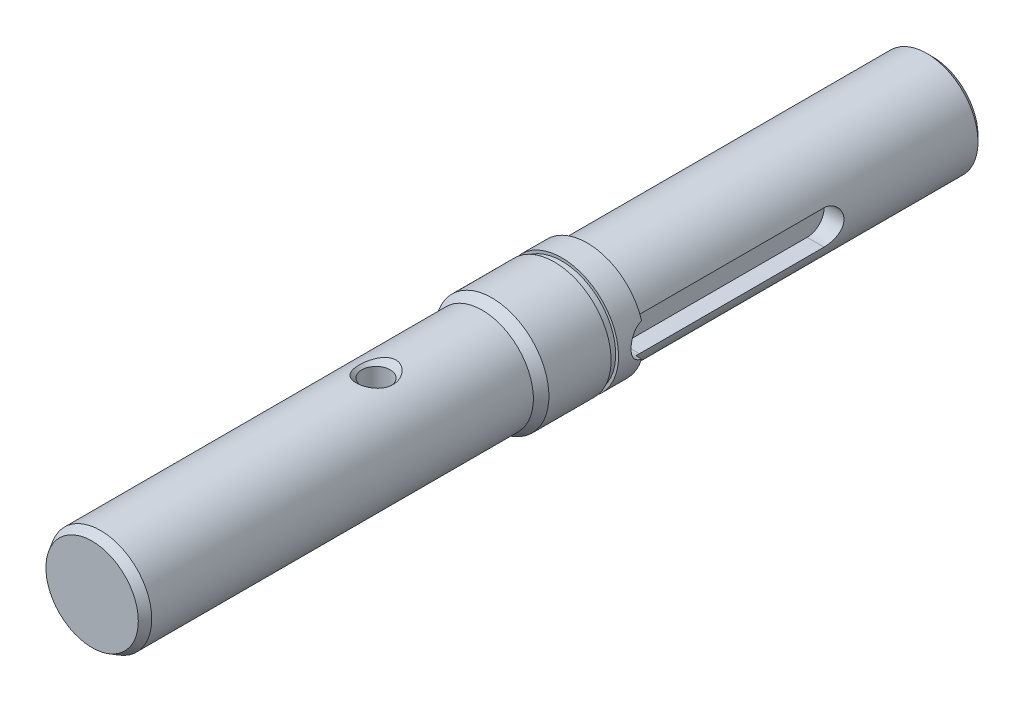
from build123d import *

# Parameters (mm, degrees)
ESQUISSE1_R                = 9
BASE_EXTRUSION_DEPTH       = 148
CHANFREIN1_SIZE            = 1
TROU_TARAUD_M8X1_251_D     = 6.8
TROU_TARAUD_M8X1_251_DEPTH = 30.5
TROU_TARAUD_M8X1_251_TIP   = 2.042926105
ENL_V_MAT_EXTRU_2_DEPTH    = 10
CHANFREIN2_SIZE            = 1.5
CHANFREIN2_SIZE2           = 0.866025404
ESQUISSE12_W               = 2.5
ESQUISSE12_H               = 1.3


with BuildPart() as part:
    # Esquisse1 → Base-Extrusion (new body)
    with BuildSketch(Plane.XY):
        Circle(ESQUISSE1_R)
    extrude(amount=BASE_EXTRUSION_DEPTH)

    # Chanfrein1
    chanfrein1_edges = [part.edges().sort_by_distance(p)[0] for p in [
        (-9, 0, 0),
    ]]
    chamfer(chanfrein1_edges, length=CHANFREIN1_SIZE)

    # Trou taraud_ M8x1.251
    with Locations(Plane(origin=(0, 0, 0), x_dir=(-1, 0, 0), z_dir=(0, 0, -1))):
        with Locations((0, 0)):
            Hole(TROU_TARAUD_M8X1_251_D / 2, depth=TROU_TARAUD_M8X1_251_DEPTH)
            with Locations((0, 0, -(TROU_TARAUD_M8X1_251_DEPTH + TROU_TARAUD_M8X1_251_TIP / 2))):  # 118° drill point
                Cone(0, TROU_TARAUD_M8X1_251_D / 2, TROU_TARAUD_M8X1_251_TIP, mode=Mode.SUBTRACT)

    # Esquisse11 → R_volution1 (revolve)
    with BuildSketch(Plane(origin=(0, 0, 0), x_dir=(1, 0, 0), z_dir=(0, 1, 0)), mode=Mode.PRIVATE) as r_volution1_sk:
        Polygon((9, -60.8), (10, -60.8), (10, -77.567949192), (9, -79.3), align=None)
    revolve(r_volution1_sk.sketch.rotate(Axis((0, 0, 0), (0, 0, 1)), 180), axis=Axis((0, 0, 0), (0, 0, 1)))

    # Esquisse7 → Enl_v. mat.-Extru.2 (cut)
    with BuildSketch(Plane(origin=(5.5, 0, 0), x_dir=(0, 0, -1), z_dir=(1, 0, 0))):
        with BuildLine():
            Line((-60.1, 3), (-27.6, 3))
            ThreePointArc((-27.6, 3), (-24.6, 0), (-27.6, -3))
            Line((-27.6, -3), (-60.1, -3))
            ThreePointArc((-60.1, -3), (-63.1, 0), (-60.1, 3))
        make_face()
    extrude(amount=ENL_V_MAT_EXTRU_2_DEPTH, mode=Mode.SUBTRACT)

    # Chanfrein2
    chanfrein2_edges = [part.edges().sort_by_distance(p)[0] for p in [
        (-9, 0, 148),
    ]]
    chanfrein2_side = [part.faces().sort_by_distance(p)[0] for p in [
        (-9, 0, 113.65),
    ]]
    chamfer(chanfrein2_edges, length=CHANFREIN2_SIZE, length2=CHANFREIN2_SIZE2, reference=chanfrein2_side[0])

    # Esquisse10 → Enl_vement de mati_re-R_volution2 (revolve, cut)
    with BuildSketch(Plane(origin=(0, 0, 0), x_dir=(0, -1, 0), z_dir=(1, 0, 0))):
        Polygon((-8, -95.5), (8, -95.5), (10, -93.5), (10, -98), (-10, -98), (-10, -93.5), align=None)
    revolve(axis=Axis((0, -20.075462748, 98), (0, 1, 0)), mode=Mode.SUBTRACT)

    # Esquisse12 → Enl_vement de mati_re-R_volution3 (revolve, cut)
    with BuildSketch(Plane(origin=(0, 0, 0), x_dir=(1, 0, 0), z_dir=(0, 1, 0)), mode=Mode.PRIVATE) as enl_vement_de_mati_re_r_volution3_sk:
        with Locations((10.75, -65.95)):
            Rectangle(ESQUISSE12_W, ESQUISSE12_H)
    revolve(enl_vement_de_mati_re_r_volution3_sk.sketch.rotate(Axis((0, 0, 0), (0, 0, 1)), 340.528779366), axis=Axis((0, 0, 0), (0, 0, 1)), mode=Mode.SUBTRACT)


solid = part.part
